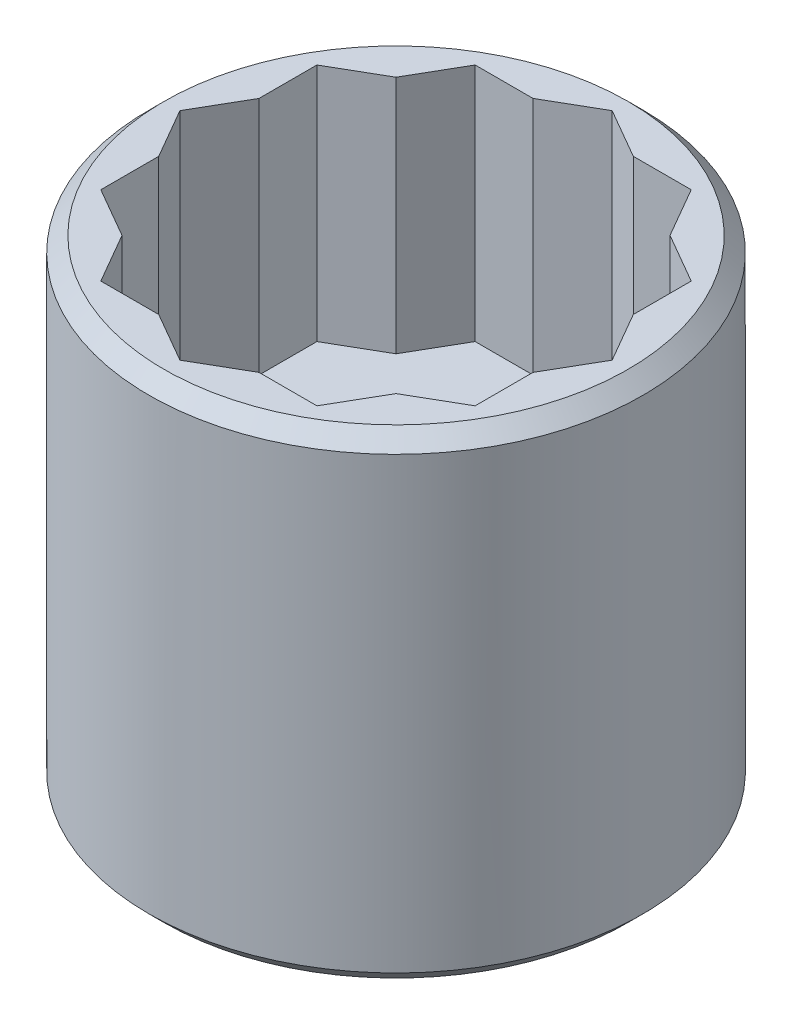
from build123d import *

# Parameters (mm, degrees)
SKETCH1_R        = 13.096875
CYLINDER_DEPTH   = 25.4
F_6_POINT_DEPTH  = 12.7
F_12_POINT_DEPTH = 12.7
DRIVE_REACH      = 33.436
SKETCH4_W        = 6.35
SKETCH4_H        = 6.35
CHAMFER1_SIZE    = 0.79375


with BuildPart() as part:
    # Sketch1 → Cylinder (new body)
    with BuildSketch(Plane(origin=(0, 0, 0), x_dir=(1, 0, 0), z_dir=(0, 1, 0))):
        with Locations(Location((0, 0, 0), (0, 0, 270))):
            Circle(SKETCH1_R)
    extrude(amount=CYLINDER_DEPTH)

    # Sketch2 → 6 Point (cut)
    with BuildSketch(Plane(origin=(0, 25.4, 0), x_dir=(-1, 0, 0), z_dir=(0, 1, 0))):
        Polygon((-11.456794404, 0), (-5.728397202, -9.921875), (5.728397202, -9.921875), (11.456794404, 0), (5.728397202, 9.921875), (-5.728397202, 9.921875), align=None)
    extrude(amount=-F_6_POINT_DEPTH, mode=Mode.SUBTRACT)

    # Sketch3 → 12 Point (cut)
    with BuildSketch(Plane(origin=(-3.872018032, 25.4, 9.384979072), x_dir=(-1, 0, 0), z_dir=(0, 1, 0))):
        Polygon((-13.793893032, -15.113376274), (-3.872018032, -20.841773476), (6.049856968, -15.113376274), (6.049856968, -3.65658187), (-3.872018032, 2.071815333), (-13.793893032, -3.65658187), align=None)
    extrude(amount=-F_12_POINT_DEPTH, mode=Mode.SUBTRACT)

    # Sketch4 → Drive (cut, up to next)
    with BuildSketch(Plane.XZ, mode=Mode.PRIVATE) as drive_sk1:
        Rectangle(SKETCH4_W, SKETCH4_H)
    drive_tool1 = extrude(drive_sk1.sketch, amount=-DRIVE_REACH, mode=Mode.PRIVATE) & part.part
    add(drive_tool1.solids().sort_by_distance((0, 0, 0))[0], mode=Mode.SUBTRACT)

    # Chamfer1
    chamfer1_edges = [part.edges().sort_by_distance(p)[0] for p in [
        (0, 0, -13.096875),
        (0, 25.4, -13.096875),
    ]]
    chamfer(chamfer1_edges, length=CHAMFER1_SIZE)


solid = part.part
